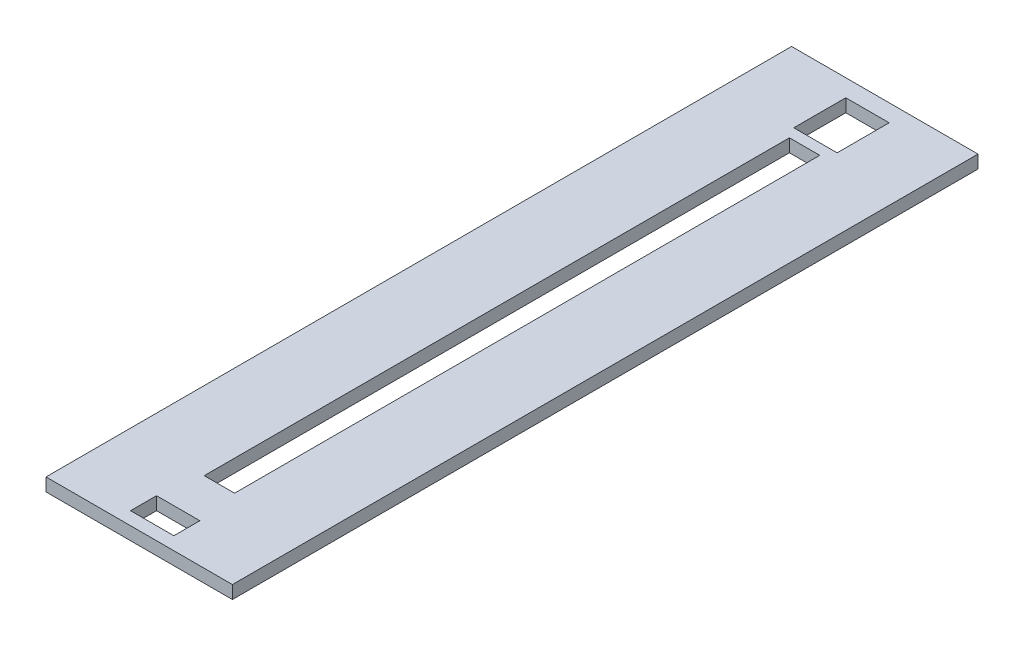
ISO-10303-21;
HEADER;
FILE_DESCRIPTION(('STEP AP214'),'2;1');
FILE_NAME('part.step','',(''),(''),'','','');
FILE_SCHEMA(('AUTOMOTIVE_DESIGN { 1 0 10303 214 1 1 1 1 }'));
ENDSEC;
DATA;
#1=APPLICATION_CONTEXT('core data for automotive mechanical design processes');
#2=APPLICATION_PROTOCOL_DEFINITION('international standard','automotive_design',2000,#1);
#3=PRODUCT_CONTEXT('',#1,'mechanical');
#4=PRODUCT('Part','Part','',(#3));
#5=PRODUCT_RELATED_PRODUCT_CATEGORY('part','',(#4));
#6=PRODUCT_DEFINITION_FORMATION('','',#4);
#7=PRODUCT_DEFINITION_CONTEXT('part definition',#1,'design');
#8=PRODUCT_DEFINITION('design','',#6,#7);
#9=PRODUCT_DEFINITION_SHAPE('','',#8);
#10=(LENGTH_UNIT() NAMED_UNIT(*) SI_UNIT(.MILLI.,.METRE.));
#11=(NAMED_UNIT(*) PLANE_ANGLE_UNIT() SI_UNIT($,.RADIAN.));
#12=(NAMED_UNIT(*) SI_UNIT($,.STERADIAN.) SOLID_ANGLE_UNIT());
#13=UNCERTAINTY_MEASURE_WITH_UNIT(LENGTH_MEASURE(1.E-05),#10,'distance_accuracy_value','');
#14=(GEOMETRIC_REPRESENTATION_CONTEXT(3) GLOBAL_UNCERTAINTY_ASSIGNED_CONTEXT((#13)) GLOBAL_UNIT_ASSIGNED_CONTEXT((#10,
#11,#12)) REPRESENTATION_CONTEXT('',''));
#15=CARTESIAN_POINT('',(0.,0.,0.));
#16=DIRECTION('',(0.,0.,1.));
#17=DIRECTION('',(1.,0.,0.));
#18=AXIS2_PLACEMENT_3D('',#15,#16,#17);
#19=CARTESIAN_POINT('',(0.,3.,0.));
#20=DIRECTION('',(0.,1.,0.));
#21=DIRECTION('',(0.,0.,1.));
#22=AXIS2_PLACEMENT_3D('',#19,#20,#21);
#23=PLANE('',#22);
#24=DIRECTION('',(-1.,0.,0.));
#25=VECTOR('',#24,1.);
#26=CARTESIAN_POINT('',(-3.5,3.,-67.5));
#27=LINE('',#26,#25);
#28=CARTESIAN_POINT('',(3.5,3.,-67.5));
#29=VERTEX_POINT('',#28);
#30=CARTESIAN_POINT('',(-3.5,3.,-67.5));
#31=VERTEX_POINT('',#30);
#32=EDGE_CURVE('E184',#29,#31,#27,.T.);
#33=ORIENTED_EDGE('',*,*,#32,.F.);
#34=DIRECTION('',(0.,0.,-1.));
#35=VECTOR('',#34,1.);
#36=CARTESIAN_POINT('',(3.5,3.,-67.5));
#37=LINE('',#36,#35);
#38=CARTESIAN_POINT('',(3.50000000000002,3.,67.5));
#39=VERTEX_POINT('',#38);
#40=EDGE_CURVE('E182',#39,#29,#37,.T.);
#41=ORIENTED_EDGE('',*,*,#40,.F.);
#42=DIRECTION('',(1.,0.,0.));
#43=VECTOR('',#42,1.);
#44=CARTESIAN_POINT('',(-3.49999999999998,3.,67.5));
#45=LINE('',#44,#43);
#46=CARTESIAN_POINT('',(-3.49999999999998,3.,67.5));
#47=VERTEX_POINT('',#46);
#48=EDGE_CURVE('E190',#47,#39,#45,.T.);
#49=ORIENTED_EDGE('',*,*,#48,.F.);
#50=DIRECTION('',(0.,0.,1.));
#51=VECTOR('',#50,1.);
#52=CARTESIAN_POINT('',(-3.5,3.,-67.5));
#53=LINE('',#52,#51);
#54=EDGE_CURVE('E187',#31,#47,#53,.T.);
#55=ORIENTED_EDGE('',*,*,#54,.F.);
#56=EDGE_LOOP('',(#33,#41,#49,#55));
#57=FACE_BOUND('',#56,.T.);
#58=DIRECTION('',(0.,0.,-1.));
#59=VECTOR('',#58,1.);
#60=CARTESIAN_POINT('',(21.5,3.,-86.));
#61=LINE('',#60,#59);
#62=CARTESIAN_POINT('',(21.5,3.,86.));
#63=VERTEX_POINT('',#62);
#64=CARTESIAN_POINT('',(21.5,3.,-86.));
#65=VERTEX_POINT('',#64);
#66=EDGE_CURVE('E244',#63,#65,#61,.T.);
#67=ORIENTED_EDGE('',*,*,#66,.T.);
#68=DIRECTION('',(-1.,0.,0.));
#69=VECTOR('',#68,1.);
#70=CARTESIAN_POINT('',(-21.5,3.,-86.));
#71=LINE('',#70,#69);
#72=CARTESIAN_POINT('',(-21.5,3.,-86.));
#73=VERTEX_POINT('',#72);
#74=EDGE_CURVE('E247',#65,#73,#71,.T.);
#75=ORIENTED_EDGE('',*,*,#74,.T.);
#76=DIRECTION('',(0.,0.,1.));
#77=VECTOR('',#76,1.);
#78=CARTESIAN_POINT('',(-21.5,3.,-86.));
#79=LINE('',#78,#77);
#80=CARTESIAN_POINT('',(-21.5,3.,86.));
#81=VERTEX_POINT('',#80);
#82=EDGE_CURVE('E250',#73,#81,#79,.T.);
#83=ORIENTED_EDGE('',*,*,#82,.T.);
#84=DIRECTION('',(1.,0.,0.));
#85=VECTOR('',#84,1.);
#86=CARTESIAN_POINT('',(-21.5,3.,86.));
#87=LINE('',#86,#85);
#88=EDGE_CURVE('E252',#81,#63,#87,.T.);
#89=ORIENTED_EDGE('',*,*,#88,.T.);
#90=EDGE_LOOP('',(#67,#75,#83,#89));
#91=FACE_BOUND('',#90,.T.);
#92=DIRECTION('',(-1.,0.,0.));
#93=VECTOR('',#92,1.);
#94=CARTESIAN_POINT('',(-5.,3.,-82.));
#95=LINE('',#94,#93);
#96=CARTESIAN_POINT('',(5.,3.,-82.));
#97=VERTEX_POINT('',#96);
#98=CARTESIAN_POINT('',(-5.,3.,-82.));
#99=VERTEX_POINT('',#98);
#100=EDGE_CURVE('E215',#97,#99,#95,.T.);
#101=ORIENTED_EDGE('',*,*,#100,.F.);
#102=DIRECTION('',(0.,0.,-1.));
#103=VECTOR('',#102,1.);
#104=CARTESIAN_POINT('',(5.,3.,-82.));
#105=LINE('',#104,#103);
#106=CARTESIAN_POINT('',(5.,3.,-70.));
#107=VERTEX_POINT('',#106);
#108=EDGE_CURVE('E213',#107,#97,#105,.T.);
#109=ORIENTED_EDGE('',*,*,#108,.F.);
#110=DIRECTION('',(1.,0.,0.));
#111=VECTOR('',#110,1.);
#112=CARTESIAN_POINT('',(-5.,3.,-70.));
#113=LINE('',#112,#111);
#114=CARTESIAN_POINT('',(-5.,3.,-70.));
#115=VERTEX_POINT('',#114);
#116=EDGE_CURVE('E221',#115,#107,#113,.T.);
#117=ORIENTED_EDGE('',*,*,#116,.F.);
#118=DIRECTION('',(0.,0.,1.));
#119=VECTOR('',#118,1.);
#120=CARTESIAN_POINT('',(-5.,3.,-82.));
#121=LINE('',#120,#119);
#122=EDGE_CURVE('E218',#99,#115,#121,.T.);
#123=ORIENTED_EDGE('',*,*,#122,.F.);
#124=EDGE_LOOP('',(#101,#109,#117,#123));
#125=FACE_BOUND('',#124,.T.);
#126=DIRECTION('',(-1.,0.,0.));
#127=VECTOR('',#126,1.);
#128=CARTESIAN_POINT('',(-4.99999999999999,3.,77.));
#129=LINE('',#128,#127);
#130=CARTESIAN_POINT('',(5.00000000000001,3.,77.));
#131=VERTEX_POINT('',#130);
#132=CARTESIAN_POINT('',(-4.99999999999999,3.,77.));
#133=VERTEX_POINT('',#132);
#134=EDGE_CURVE('E154',#131,#133,#129,.T.);
#135=ORIENTED_EDGE('',*,*,#134,.F.);
#136=DIRECTION('',(0.,0.,-1.));
#137=VECTOR('',#136,1.);
#138=CARTESIAN_POINT('',(5.00000000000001,3.,77.));
#139=LINE('',#138,#137);
#140=CARTESIAN_POINT('',(5.00000000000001,3.,83.));
#141=VERTEX_POINT('',#140);
#142=EDGE_CURVE('E146',#141,#131,#139,.T.);
#143=ORIENTED_EDGE('',*,*,#142,.F.);
#144=DIRECTION('',(1.,0.,0.));
#145=VECTOR('',#144,1.);
#146=CARTESIAN_POINT('',(-4.99999999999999,3.,83.));
#147=LINE('',#146,#145);
#148=CARTESIAN_POINT('',(-4.99999999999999,3.,83.));
#149=VERTEX_POINT('',#148);
#150=EDGE_CURVE('E168',#149,#141,#147,.T.);
#151=ORIENTED_EDGE('',*,*,#150,.F.);
#152=DIRECTION('',(0.,0.,1.));
#153=VECTOR('',#152,1.);
#154=CARTESIAN_POINT('',(-4.99999999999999,3.,77.));
#155=LINE('',#154,#153);
#156=EDGE_CURVE('E166',#133,#149,#155,.T.);
#157=ORIENTED_EDGE('',*,*,#156,.F.);
#158=EDGE_LOOP('',(#135,#143,#151,#157));
#159=FACE_BOUND('',#158,.T.);
#160=ADVANCED_FACE('F33',(#57,#91,#125,#159),#23,.T.);
#161=CARTESIAN_POINT('',(0.,0.,0.));
#162=DIRECTION('',(0.,1.,0.));
#163=DIRECTION('',(0.,0.,1.));
#164=AXIS2_PLACEMENT_3D('',#161,#162,#163);
#165=PLANE('',#164);
#166=DIRECTION('',(0.,0.,-1.));
#167=VECTOR('',#166,1.);
#168=CARTESIAN_POINT('',(3.5,0.,-67.5));
#169=LINE('',#168,#167);
#170=CARTESIAN_POINT('',(3.50000000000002,0.,67.5));
#171=VERTEX_POINT('',#170);
#172=CARTESIAN_POINT('',(3.5,0.,-67.5));
#173=VERTEX_POINT('',#172);
#174=EDGE_CURVE('E162',#171,#173,#169,.T.);
#175=ORIENTED_EDGE('',*,*,#174,.T.);
#176=DIRECTION('',(-1.,0.,0.));
#177=VECTOR('',#176,1.);
#178=CARTESIAN_POINT('',(-3.5,0.,-67.5));
#179=LINE('',#178,#177);
#180=CARTESIAN_POINT('',(-3.5,0.,-67.5));
#181=VERTEX_POINT('',#180);
#182=EDGE_CURVE('E195',#173,#181,#179,.T.);
#183=ORIENTED_EDGE('',*,*,#182,.T.);
#184=DIRECTION('',(0.,0.,1.));
#185=VECTOR('',#184,1.);
#186=CARTESIAN_POINT('',(-3.5,0.,-67.5));
#187=LINE('',#186,#185);
#188=CARTESIAN_POINT('',(-3.49999999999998,0.,67.5));
#189=VERTEX_POINT('',#188);
#190=EDGE_CURVE('E198',#181,#189,#187,.T.);
#191=ORIENTED_EDGE('',*,*,#190,.T.);
#192=DIRECTION('',(1.,0.,0.));
#193=VECTOR('',#192,1.);
#194=CARTESIAN_POINT('',(-3.49999999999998,0.,67.5));
#195=LINE('',#194,#193);
#196=EDGE_CURVE('E185',#189,#171,#195,.T.);
#197=ORIENTED_EDGE('',*,*,#196,.T.);
#198=EDGE_LOOP('',(#175,#183,#191,#197));
#199=FACE_BOUND('',#198,.T.);
#200=DIRECTION('',(0.,0.,-1.));
#201=VECTOR('',#200,1.);
#202=CARTESIAN_POINT('',(21.5,0.,-86.));
#203=LINE('',#202,#201);
#204=CARTESIAN_POINT('',(21.5,0.,86.));
#205=VERTEX_POINT('',#204);
#206=CARTESIAN_POINT('',(21.5,0.,-86.));
#207=VERTEX_POINT('',#206);
#208=EDGE_CURVE('E243',#205,#207,#203,.T.);
#209=ORIENTED_EDGE('',*,*,#208,.F.);
#210=DIRECTION('',(1.,0.,0.));
#211=VECTOR('',#210,1.);
#212=CARTESIAN_POINT('',(-21.5,0.,86.));
#213=LINE('',#212,#211);
#214=CARTESIAN_POINT('',(-21.5,0.,86.));
#215=VERTEX_POINT('',#214);
#216=EDGE_CURVE('E248',#215,#205,#213,.T.);
#217=ORIENTED_EDGE('',*,*,#216,.F.);
#218=DIRECTION('',(0.,0.,1.));
#219=VECTOR('',#218,1.);
#220=CARTESIAN_POINT('',(-21.5,0.,-86.));
#221=LINE('',#220,#219);
#222=CARTESIAN_POINT('',(-21.5,0.,-86.));
#223=VERTEX_POINT('',#222);
#224=EDGE_CURVE('E259',#223,#215,#221,.T.);
#225=ORIENTED_EDGE('',*,*,#224,.F.);
#226=DIRECTION('',(-1.,0.,0.));
#227=VECTOR('',#226,1.);
#228=CARTESIAN_POINT('',(-21.5,0.,-86.));
#229=LINE('',#228,#227);
#230=EDGE_CURVE('E257',#207,#223,#229,.T.);
#231=ORIENTED_EDGE('',*,*,#230,.F.);
#232=EDGE_LOOP('',(#209,#217,#225,#231));
#233=FACE_BOUND('',#232,.T.);
#234=DIRECTION('',(0.,0.,-1.));
#235=VECTOR('',#234,1.);
#236=CARTESIAN_POINT('',(5.,0.,-82.));
#237=LINE('',#236,#235);
#238=CARTESIAN_POINT('',(5.,0.,-70.));
#239=VERTEX_POINT('',#238);
#240=CARTESIAN_POINT('',(5.,0.,-82.));
#241=VERTEX_POINT('',#240);
#242=EDGE_CURVE('E212',#239,#241,#237,.T.);
#243=ORIENTED_EDGE('',*,*,#242,.T.);
#244=DIRECTION('',(-1.,0.,0.));
#245=VECTOR('',#244,1.);
#246=CARTESIAN_POINT('',(-5.,0.,-82.));
#247=LINE('',#246,#245);
#248=CARTESIAN_POINT('',(-5.,0.,-82.));
#249=VERTEX_POINT('',#248);
#250=EDGE_CURVE('E226',#241,#249,#247,.T.);
#251=ORIENTED_EDGE('',*,*,#250,.T.);
#252=DIRECTION('',(0.,0.,1.));
#253=VECTOR('',#252,1.);
#254=CARTESIAN_POINT('',(-5.,0.,-82.));
#255=LINE('',#254,#253);
#256=CARTESIAN_POINT('',(-5.,0.,-70.));
#257=VERTEX_POINT('',#256);
#258=EDGE_CURVE('E229',#249,#257,#255,.T.);
#259=ORIENTED_EDGE('',*,*,#258,.T.);
#260=DIRECTION('',(1.,0.,0.));
#261=VECTOR('',#260,1.);
#262=CARTESIAN_POINT('',(-5.,0.,-70.));
#263=LINE('',#262,#261);
#264=EDGE_CURVE('E216',#257,#239,#263,.T.);
#265=ORIENTED_EDGE('',*,*,#264,.T.);
#266=EDGE_LOOP('',(#243,#251,#259,#265));
#267=FACE_BOUND('',#266,.T.);
#268=DIRECTION('',(0.,0.,-1.));
#269=VECTOR('',#268,1.);
#270=CARTESIAN_POINT('',(5.00000000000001,0.,77.));
#271=LINE('',#270,#269);
#272=CARTESIAN_POINT('',(5.00000000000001,0.,83.));
#273=VERTEX_POINT('',#272);
#274=CARTESIAN_POINT('',(5.00000000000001,0.,77.));
#275=VERTEX_POINT('',#274);
#276=EDGE_CURVE('E56',#273,#275,#271,.T.);
#277=ORIENTED_EDGE('',*,*,#276,.T.);
#278=DIRECTION('',(-1.,0.,0.));
#279=VECTOR('',#278,1.);
#280=CARTESIAN_POINT('',(-4.99999999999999,0.,77.));
#281=LINE('',#280,#279);
#282=CARTESIAN_POINT('',(-4.99999999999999,0.,77.));
#283=VERTEX_POINT('',#282);
#284=EDGE_CURVE('E161',#275,#283,#281,.T.);
#285=ORIENTED_EDGE('',*,*,#284,.T.);
#286=DIRECTION('',(0.,0.,1.));
#287=VECTOR('',#286,1.);
#288=CARTESIAN_POINT('',(-4.99999999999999,0.,77.));
#289=LINE('',#288,#287);
#290=CARTESIAN_POINT('',(-4.99999999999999,0.,83.));
#291=VERTEX_POINT('',#290);
#292=EDGE_CURVE('E174',#283,#291,#289,.T.);
#293=ORIENTED_EDGE('',*,*,#292,.T.);
#294=DIRECTION('',(1.,0.,0.));
#295=VECTOR('',#294,1.);
#296=CARTESIAN_POINT('',(-4.99999999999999,0.,83.));
#297=LINE('',#296,#295);
#298=EDGE_CURVE('E155',#291,#273,#297,.T.);
#299=ORIENTED_EDGE('',*,*,#298,.T.);
#300=EDGE_LOOP('',(#277,#285,#293,#299));
#301=FACE_BOUND('',#300,.T.);
#302=ADVANCED_FACE('F277',(#199,#233,#267,#301),#165,.F.);
#303=CARTESIAN_POINT('',(21.5,3.,-86.));
#304=DIRECTION('',(-1.,0.,0.));
#305=DIRECTION('',(0.,0.,1.));
#306=AXIS2_PLACEMENT_3D('',#303,#304,#305);
#307=PLANE('',#306);
#308=ORIENTED_EDGE('',*,*,#208,.T.);
#309=DIRECTION('',(0.,-1.,0.));
#310=VECTOR('',#309,1.);
#311=CARTESIAN_POINT('',(21.5,3.,-86.));
#312=LINE('',#311,#310);
#313=EDGE_CURVE('E11',#65,#207,#312,.T.);
#314=ORIENTED_EDGE('',*,*,#313,.F.);
#315=ORIENTED_EDGE('',*,*,#66,.F.);
#316=DIRECTION('',(0.,-1.,0.));
#317=VECTOR('',#316,1.);
#318=CARTESIAN_POINT('',(21.5,3.,86.));
#319=LINE('',#318,#317);
#320=EDGE_CURVE('E254',#63,#205,#319,.T.);
#321=ORIENTED_EDGE('',*,*,#320,.T.);
#322=EDGE_LOOP('',(#308,#314,#315,#321));
#323=FACE_BOUND('',#322,.T.);
#324=ADVANCED_FACE('F35',(#323),#307,.F.);
#325=CARTESIAN_POINT('',(-21.5,3.,-86.));
#326=DIRECTION('',(0.,0.,1.));
#327=DIRECTION('',(1.,0.,0.));
#328=AXIS2_PLACEMENT_3D('',#325,#326,#327);
#329=PLANE('',#328);
#330=ORIENTED_EDGE('',*,*,#230,.T.);
#331=DIRECTION('',(0.,-1.,0.));
#332=VECTOR('',#331,1.);
#333=CARTESIAN_POINT('',(-21.5,3.,-86.));
#334=LINE('',#333,#332);
#335=EDGE_CURVE('E41',#73,#223,#334,.T.);
#336=ORIENTED_EDGE('',*,*,#335,.F.);
#337=ORIENTED_EDGE('',*,*,#74,.F.);
#338=ORIENTED_EDGE('',*,*,#313,.T.);
#339=EDGE_LOOP('',(#330,#336,#337,#338));
#340=FACE_BOUND('',#339,.T.);
#341=ADVANCED_FACE('F288',(#340),#329,.F.);
#342=CARTESIAN_POINT('',(-21.5,3.,-86.));
#343=DIRECTION('',(1.,0.,0.));
#344=DIRECTION('',(0.,0.,-1.));
#345=AXIS2_PLACEMENT_3D('',#342,#343,#344);
#346=PLANE('',#345);
#347=ORIENTED_EDGE('',*,*,#224,.T.);
#348=DIRECTION('',(0.,-1.,0.));
#349=VECTOR('',#348,1.);
#350=CARTESIAN_POINT('',(-21.5,3.,86.));
#351=LINE('',#350,#349);
#352=EDGE_CURVE('E264',#81,#215,#351,.T.);
#353=ORIENTED_EDGE('',*,*,#352,.F.);
#354=ORIENTED_EDGE('',*,*,#82,.F.);
#355=ORIENTED_EDGE('',*,*,#335,.T.);
#356=EDGE_LOOP('',(#347,#353,#354,#355));
#357=FACE_BOUND('',#356,.T.);
#358=ADVANCED_FACE('F271',(#357),#346,.F.);
#359=CARTESIAN_POINT('',(-21.5,3.,86.));
#360=DIRECTION('',(0.,0.,-1.));
#361=DIRECTION('',(-1.,0.,0.));
#362=AXIS2_PLACEMENT_3D('',#359,#360,#361);
#363=PLANE('',#362);
#364=ORIENTED_EDGE('',*,*,#216,.T.);
#365=ORIENTED_EDGE('',*,*,#320,.F.);
#366=ORIENTED_EDGE('',*,*,#88,.F.);
#367=ORIENTED_EDGE('',*,*,#352,.T.);
#368=EDGE_LOOP('',(#364,#365,#366,#367));
#369=FACE_BOUND('',#368,.T.);
#370=ADVANCED_FACE('F281',(#369),#363,.F.);
#371=CARTESIAN_POINT('',(5.,3.,-82.));
#372=DIRECTION('',(-1.,0.,0.));
#373=DIRECTION('',(0.,0.,1.));
#374=AXIS2_PLACEMENT_3D('',#371,#372,#373);
#375=PLANE('',#374);
#376=ORIENTED_EDGE('',*,*,#242,.F.);
#377=DIRECTION('',(0.,-1.,0.));
#378=VECTOR('',#377,1.);
#379=CARTESIAN_POINT('',(5.,3.,-70.));
#380=LINE('',#379,#378);
#381=EDGE_CURVE('E223',#107,#239,#380,.T.);
#382=ORIENTED_EDGE('',*,*,#381,.F.);
#383=ORIENTED_EDGE('',*,*,#108,.T.);
#384=DIRECTION('',(0.,-1.,0.));
#385=VECTOR('',#384,1.);
#386=CARTESIAN_POINT('',(5.,3.,-82.));
#387=LINE('',#386,#385);
#388=EDGE_CURVE('E240',#97,#241,#387,.T.);
#389=ORIENTED_EDGE('',*,*,#388,.T.);
#390=EDGE_LOOP('',(#376,#382,#383,#389));
#391=FACE_BOUND('',#390,.T.);
#392=ADVANCED_FACE('F305',(#391),#375,.T.);
#393=CARTESIAN_POINT('',(-5.,3.,-82.));
#394=DIRECTION('',(0.,0.,1.));
#395=DIRECTION('',(1.,0.,0.));
#396=AXIS2_PLACEMENT_3D('',#393,#394,#395);
#397=PLANE('',#396);
#398=ORIENTED_EDGE('',*,*,#250,.F.);
#399=ORIENTED_EDGE('',*,*,#388,.F.);
#400=ORIENTED_EDGE('',*,*,#100,.T.);
#401=DIRECTION('',(0.,-1.,0.));
#402=VECTOR('',#401,1.);
#403=CARTESIAN_POINT('',(-5.,3.,-82.));
#404=LINE('',#403,#402);
#405=EDGE_CURVE('E238',#99,#249,#404,.T.);
#406=ORIENTED_EDGE('',*,*,#405,.T.);
#407=EDGE_LOOP('',(#398,#399,#400,#406));
#408=FACE_BOUND('',#407,.T.);
#409=ADVANCED_FACE('F312',(#408),#397,.T.);
#410=CARTESIAN_POINT('',(-5.,3.,-82.));
#411=DIRECTION('',(1.,0.,0.));
#412=DIRECTION('',(0.,0.,-1.));
#413=AXIS2_PLACEMENT_3D('',#410,#411,#412);
#414=PLANE('',#413);
#415=ORIENTED_EDGE('',*,*,#258,.F.);
#416=ORIENTED_EDGE('',*,*,#405,.F.);
#417=ORIENTED_EDGE('',*,*,#122,.T.);
#418=DIRECTION('',(0.,-1.,0.));
#419=VECTOR('',#418,1.);
#420=CARTESIAN_POINT('',(-5.,3.,-70.));
#421=LINE('',#420,#419);
#422=EDGE_CURVE('E236',#115,#257,#421,.T.);
#423=ORIENTED_EDGE('',*,*,#422,.T.);
#424=EDGE_LOOP('',(#415,#416,#417,#423));
#425=FACE_BOUND('',#424,.T.);
#426=ADVANCED_FACE('F317',(#425),#414,.T.);
#427=CARTESIAN_POINT('',(-5.,3.,-70.));
#428=DIRECTION('',(0.,0.,-1.));
#429=DIRECTION('',(-1.,0.,0.));
#430=AXIS2_PLACEMENT_3D('',#427,#428,#429);
#431=PLANE('',#430);
#432=ORIENTED_EDGE('',*,*,#264,.F.);
#433=ORIENTED_EDGE('',*,*,#422,.F.);
#434=ORIENTED_EDGE('',*,*,#116,.T.);
#435=ORIENTED_EDGE('',*,*,#381,.T.);
#436=EDGE_LOOP('',(#432,#433,#434,#435));
#437=FACE_BOUND('',#436,.T.);
#438=ADVANCED_FACE('F324',(#437),#431,.T.);
#439=CARTESIAN_POINT('',(3.5,3.,-67.5));
#440=DIRECTION('',(-1.,0.,0.));
#441=DIRECTION('',(0.,0.,1.));
#442=AXIS2_PLACEMENT_3D('',#439,#440,#441);
#443=PLANE('',#442);
#444=ORIENTED_EDGE('',*,*,#174,.F.);
#445=DIRECTION('',(0.,-1.,0.));
#446=VECTOR('',#445,1.);
#447=CARTESIAN_POINT('',(3.50000000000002,3.,67.5));
#448=LINE('',#447,#446);
#449=EDGE_CURVE('E192',#39,#171,#448,.T.);
#450=ORIENTED_EDGE('',*,*,#449,.F.);
#451=ORIENTED_EDGE('',*,*,#40,.T.);
#452=DIRECTION('',(0.,-1.,0.));
#453=VECTOR('',#452,1.);
#454=CARTESIAN_POINT('',(3.5,3.,-67.5));
#455=LINE('',#454,#453);
#456=EDGE_CURVE('E209',#29,#173,#455,.T.);
#457=ORIENTED_EDGE('',*,*,#456,.T.);
#458=EDGE_LOOP('',(#444,#450,#451,#457));
#459=FACE_BOUND('',#458,.T.);
#460=ADVANCED_FACE('F337',(#459),#443,.T.);
#461=CARTESIAN_POINT('',(-3.5,3.,-67.5));
#462=DIRECTION('',(0.,0.,1.));
#463=DIRECTION('',(1.,0.,0.));
#464=AXIS2_PLACEMENT_3D('',#461,#462,#463);
#465=PLANE('',#464);
#466=ORIENTED_EDGE('',*,*,#182,.F.);
#467=ORIENTED_EDGE('',*,*,#456,.F.);
#468=ORIENTED_EDGE('',*,*,#32,.T.);
#469=DIRECTION('',(0.,-1.,0.));
#470=VECTOR('',#469,1.);
#471=CARTESIAN_POINT('',(-3.5,3.,-67.5));
#472=LINE('',#471,#470);
#473=EDGE_CURVE('E207',#31,#181,#472,.T.);
#474=ORIENTED_EDGE('',*,*,#473,.T.);
#475=EDGE_LOOP('',(#466,#467,#468,#474));
#476=FACE_BOUND('',#475,.T.);
#477=ADVANCED_FACE('F342',(#476),#465,.T.);
#478=CARTESIAN_POINT('',(-3.5,3.,-67.5));
#479=DIRECTION('',(1.,0.,0.));
#480=DIRECTION('',(0.,0.,-1.));
#481=AXIS2_PLACEMENT_3D('',#478,#479,#480);
#482=PLANE('',#481);
#483=ORIENTED_EDGE('',*,*,#190,.F.);
#484=ORIENTED_EDGE('',*,*,#473,.F.);
#485=ORIENTED_EDGE('',*,*,#54,.T.);
#486=DIRECTION('',(0.,-1.,0.));
#487=VECTOR('',#486,1.);
#488=CARTESIAN_POINT('',(-3.49999999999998,3.,67.5));
#489=LINE('',#488,#487);
#490=EDGE_CURVE('E205',#47,#189,#489,.T.);
#491=ORIENTED_EDGE('',*,*,#490,.T.);
#492=EDGE_LOOP('',(#483,#484,#485,#491));
#493=FACE_BOUND('',#492,.T.);
#494=ADVANCED_FACE('F346',(#493),#482,.T.);
#495=CARTESIAN_POINT('',(-3.49999999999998,3.,67.5));
#496=DIRECTION('',(0.,0.,-1.));
#497=DIRECTION('',(-1.,0.,0.));
#498=AXIS2_PLACEMENT_3D('',#495,#496,#497);
#499=PLANE('',#498);
#500=ORIENTED_EDGE('',*,*,#196,.F.);
#501=ORIENTED_EDGE('',*,*,#490,.F.);
#502=ORIENTED_EDGE('',*,*,#48,.T.);
#503=ORIENTED_EDGE('',*,*,#449,.T.);
#504=EDGE_LOOP('',(#500,#501,#502,#503));
#505=FACE_BOUND('',#504,.T.);
#506=ADVANCED_FACE('F350',(#505),#499,.T.);
#507=CARTESIAN_POINT('',(5.00000000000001,3.,77.));
#508=DIRECTION('',(-1.,0.,0.));
#509=DIRECTION('',(0.,0.,1.));
#510=AXIS2_PLACEMENT_3D('',#507,#508,#509);
#511=PLANE('',#510);
#512=ORIENTED_EDGE('',*,*,#276,.F.);
#513=DIRECTION('',(0.,-1.,0.));
#514=VECTOR('',#513,1.);
#515=CARTESIAN_POINT('',(5.00000000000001,3.,83.));
#516=LINE('',#515,#514);
#517=EDGE_CURVE('E150',#141,#273,#516,.T.);
#518=ORIENTED_EDGE('',*,*,#517,.F.);
#519=ORIENTED_EDGE('',*,*,#142,.T.);
#520=DIRECTION('',(0.,-1.,0.));
#521=VECTOR('',#520,1.);
#522=CARTESIAN_POINT('',(5.00000000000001,3.,77.));
#523=LINE('',#522,#521);
#524=EDGE_CURVE('E149',#131,#275,#523,.T.);
#525=ORIENTED_EDGE('',*,*,#524,.T.);
#526=EDGE_LOOP('',(#512,#518,#519,#525));
#527=FACE_BOUND('',#526,.T.);
#528=ADVANCED_FACE('F148',(#527),#511,.T.);
#529=CARTESIAN_POINT('',(-4.99999999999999,3.,77.));
#530=DIRECTION('',(0.,0.,1.));
#531=DIRECTION('',(1.,0.,0.));
#532=AXIS2_PLACEMENT_3D('',#529,#530,#531);
#533=PLANE('',#532);
#534=ORIENTED_EDGE('',*,*,#284,.F.);
#535=ORIENTED_EDGE('',*,*,#524,.F.);
#536=ORIENTED_EDGE('',*,*,#134,.T.);
#537=DIRECTION('',(0.,-1.,0.));
#538=VECTOR('',#537,1.);
#539=CARTESIAN_POINT('',(-4.99999999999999,3.,77.));
#540=LINE('',#539,#538);
#541=EDGE_CURVE('E163',#133,#283,#540,.T.);
#542=ORIENTED_EDGE('',*,*,#541,.T.);
#543=EDGE_LOOP('',(#534,#535,#536,#542));
#544=FACE_BOUND('',#543,.T.);
#545=ADVANCED_FACE('F158',(#544),#533,.T.);
#546=CARTESIAN_POINT('',(-4.99999999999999,3.,77.));
#547=DIRECTION('',(1.,0.,0.));
#548=DIRECTION('',(0.,0.,-1.));
#549=AXIS2_PLACEMENT_3D('',#546,#547,#548);
#550=PLANE('',#549);
#551=ORIENTED_EDGE('',*,*,#292,.F.);
#552=ORIENTED_EDGE('',*,*,#541,.F.);
#553=ORIENTED_EDGE('',*,*,#156,.T.);
#554=DIRECTION('',(0.,-1.,0.));
#555=VECTOR('',#554,1.);
#556=CARTESIAN_POINT('',(-4.99999999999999,3.,83.));
#557=LINE('',#556,#555);
#558=EDGE_CURVE('E48',#149,#291,#557,.T.);
#559=ORIENTED_EDGE('',*,*,#558,.T.);
#560=EDGE_LOOP('',(#551,#552,#553,#559));
#561=FACE_BOUND('',#560,.T.);
#562=ADVANCED_FACE('F359',(#561),#550,.T.);
#563=CARTESIAN_POINT('',(-4.99999999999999,3.,83.));
#564=DIRECTION('',(0.,0.,-1.));
#565=DIRECTION('',(-1.,0.,0.));
#566=AXIS2_PLACEMENT_3D('',#563,#564,#565);
#567=PLANE('',#566);
#568=ORIENTED_EDGE('',*,*,#298,.F.);
#569=ORIENTED_EDGE('',*,*,#558,.F.);
#570=ORIENTED_EDGE('',*,*,#150,.T.);
#571=ORIENTED_EDGE('',*,*,#517,.T.);
#572=EDGE_LOOP('',(#568,#569,#570,#571));
#573=FACE_BOUND('',#572,.T.);
#574=ADVANCED_FACE('F362',(#573),#567,.T.);
#575=CLOSED_SHELL('',(#160,#302,#324,#341,#358,#370,#392,#409,#426,#438,#460,#477,#494,#506,
#528,#545,#562,#574));
#576=MANIFOLD_SOLID_BREP('B2',#575);
#577=ADVANCED_BREP_SHAPE_REPRESENTATION('',(#18,#576),#14);
#578=SHAPE_DEFINITION_REPRESENTATION(#9,#577);
ENDSEC;
END-ISO-10303-21;
